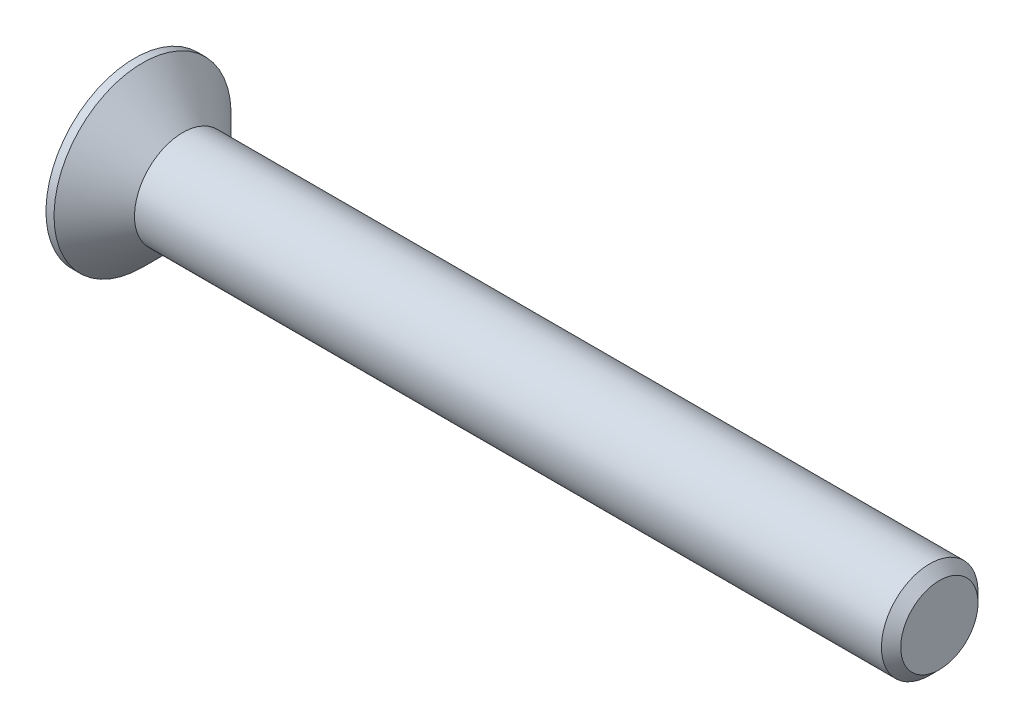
ISO-10303-21;
HEADER;
FILE_DESCRIPTION(('STEP AP214'),'2;1');
FILE_NAME('part.step','',(''),(''),'','','');
FILE_SCHEMA(('AUTOMOTIVE_DESIGN { 1 0 10303 214 1 1 1 1 }'));
ENDSEC;
DATA;
#1=APPLICATION_CONTEXT('core data for automotive mechanical design processes');
#2=APPLICATION_PROTOCOL_DEFINITION('international standard','automotive_design',2000,#1);
#3=PRODUCT_CONTEXT('',#1,'mechanical');
#4=PRODUCT('Part','Part','',(#3));
#5=PRODUCT_RELATED_PRODUCT_CATEGORY('part','',(#4));
#6=PRODUCT_DEFINITION_FORMATION('','',#4);
#7=PRODUCT_DEFINITION_CONTEXT('part definition',#1,'design');
#8=PRODUCT_DEFINITION('design','',#6,#7);
#9=PRODUCT_DEFINITION_SHAPE('','',#8);
#10=(LENGTH_UNIT() NAMED_UNIT(*) SI_UNIT(.MILLI.,.METRE.));
#11=(NAMED_UNIT(*) PLANE_ANGLE_UNIT() SI_UNIT($,.RADIAN.));
#12=(NAMED_UNIT(*) SI_UNIT($,.STERADIAN.) SOLID_ANGLE_UNIT());
#13=UNCERTAINTY_MEASURE_WITH_UNIT(LENGTH_MEASURE(1.E-05),#10,'distance_accuracy_value','');
#14=(GEOMETRIC_REPRESENTATION_CONTEXT(3) GLOBAL_UNCERTAINTY_ASSIGNED_CONTEXT((#13)) GLOBAL_UNIT_ASSIGNED_CONTEXT((#10,
#11,#12)) REPRESENTATION_CONTEXT('',''));
#15=CARTESIAN_POINT('',(0.,0.,0.));
#16=DIRECTION('',(0.,0.,1.));
#17=DIRECTION('',(1.,0.,0.));
#18=AXIS2_PLACEMENT_3D('',#15,#16,#17);
#19=CARTESIAN_POINT('',(0.,0.,0.));
#20=DIRECTION('',(-1.,0.,0.));
#21=DIRECTION('',(0.,-1.,0.));
#22=AXIS2_PLACEMENT_3D('',#19,#20,#21);
#23=CONICAL_SURFACE('',#22,3.,0.78539816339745);
#24=CARTESIAN_POINT('',(-2.49999999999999,0.,0.));
#25=DIRECTION('',(-1.,0.,0.));
#26=DIRECTION('',(0.,-1.,0.));
#27=AXIS2_PLACEMENT_3D('',#24,#25,#26);
#28=CIRCLE('',#27,5.5);
#29=CARTESIAN_POINT('',(-2.49999999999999,-5.5,0.));
#30=VERTEX_POINT('',#29);
#31=EDGE_CURVE('E189',#30,#30,#28,.T.);
#32=ORIENTED_EDGE('',*,*,#31,.F.);
#33=EDGE_LOOP('',(#32));
#34=FACE_BOUND('',#33,.T.);
#35=CARTESIAN_POINT('',(0.,0.,0.));
#36=DIRECTION('',(-1.,0.,0.));
#37=DIRECTION('',(0.,-1.,0.));
#38=AXIS2_PLACEMENT_3D('',#35,#36,#37);
#39=CIRCLE('',#38,3.);
#40=CARTESIAN_POINT('',(0.,-3.,0.));
#41=VERTEX_POINT('',#40);
#42=EDGE_CURVE('E212',#41,#41,#39,.T.);
#43=ORIENTED_EDGE('',*,*,#42,.T.);
#44=EDGE_LOOP('',(#43));
#45=FACE_BOUND('',#44,.T.);
#46=ADVANCED_FACE('F33',(#34,#45),#23,.T.);
#47=CARTESIAN_POINT('',(-3.,0.,0.));
#48=DIRECTION('',(-1.,0.,0.));
#49=DIRECTION('',(0.,-1.,0.));
#50=AXIS2_PLACEMENT_3D('',#47,#48,#49);
#51=CYLINDRICAL_SURFACE('',#50,3.);
#52=CARTESIAN_POINT('',(46.4,0.,0.));
#53=DIRECTION('',(-1.,0.,0.));
#54=DIRECTION('',(0.,-1.,0.));
#55=AXIS2_PLACEMENT_3D('',#52,#53,#54);
#56=CIRCLE('',#55,3.);
#57=CARTESIAN_POINT('',(46.4,-3.,0.));
#58=VERTEX_POINT('',#57);
#59=EDGE_CURVE('E41',#58,#58,#56,.T.);
#60=ORIENTED_EDGE('',*,*,#59,.T.);
#61=EDGE_LOOP('',(#60));
#62=FACE_BOUND('',#61,.T.);
#63=ORIENTED_EDGE('',*,*,#42,.F.);
#64=EDGE_LOOP('',(#63));
#65=FACE_BOUND('',#64,.T.);
#66=ADVANCED_FACE('F217',(#62,#65),#51,.T.);
#67=CARTESIAN_POINT('',(47.,0.,0.));
#68=DIRECTION('',(-1.,0.,0.));
#69=DIRECTION('',(0.,-1.,0.));
#70=AXIS2_PLACEMENT_3D('',#67,#68,#69);
#71=PLANE('',#70);
#72=CARTESIAN_POINT('',(47.,0.,0.));
#73=DIRECTION('',(-1.,0.,0.));
#74=DIRECTION('',(0.,-1.,0.));
#75=AXIS2_PLACEMENT_3D('',#72,#73,#74);
#76=CIRCLE('',#75,2.40000000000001);
#77=CARTESIAN_POINT('',(47.,-2.40000000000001,0.));
#78=VERTEX_POINT('',#77);
#79=EDGE_CURVE('E11',#78,#78,#76,.F.);
#80=ORIENTED_EDGE('',*,*,#79,.T.);
#81=EDGE_LOOP('',(#80));
#82=FACE_BOUND('',#81,.T.);
#83=ADVANCED_FACE('F239',(#82),#71,.F.);
#84=CARTESIAN_POINT('',(-3.,5.5,0.));
#85=DIRECTION('',(1.,0.,0.));
#86=DIRECTION('',(0.,1.,0.));
#87=AXIS2_PLACEMENT_3D('',#84,#85,#86);
#88=PLANE('',#87);
#89=DIRECTION('',(0.,0.,-1.));
#90=VECTOR('',#89,1.);
#91=CARTESIAN_POINT('',(-3.,0.825,-3.3));
#92=LINE('',#91,#90);
#93=CARTESIAN_POINT('',(-3.,0.825,-0.825));
#94=VERTEX_POINT('',#93);
#95=CARTESIAN_POINT('',(-3.,0.825,-3.3));
#96=VERTEX_POINT('',#95);
#97=EDGE_CURVE('E158',#94,#96,#92,.T.);
#98=ORIENTED_EDGE('',*,*,#97,.F.);
#99=DIRECTION('',(0.,-1.,0.));
#100=VECTOR('',#99,1.);
#101=CARTESIAN_POINT('',(-3.,0.825,-0.825));
#102=LINE('',#101,#100);
#103=CARTESIAN_POINT('',(-3.,3.3,-0.825));
#104=VERTEX_POINT('',#103);
#105=EDGE_CURVE('E48',#104,#94,#102,.T.);
#106=ORIENTED_EDGE('',*,*,#105,.F.);
#107=DIRECTION('',(0.,0.,-1.));
#108=VECTOR('',#107,1.);
#109=CARTESIAN_POINT('',(-3.,3.3,-0.825));
#110=LINE('',#109,#108);
#111=CARTESIAN_POINT('',(-3.,3.3,0.825));
#112=VERTEX_POINT('',#111);
#113=EDGE_CURVE('E185',#112,#104,#110,.T.);
#114=ORIENTED_EDGE('',*,*,#113,.F.);
#115=DIRECTION('',(0.,1.,0.));
#116=VECTOR('',#115,1.);
#117=CARTESIAN_POINT('',(-3.,3.3,0.825));
#118=LINE('',#117,#116);
#119=CARTESIAN_POINT('',(-3.,0.825,0.825));
#120=VERTEX_POINT('',#119);
#121=EDGE_CURVE('E183',#120,#112,#118,.T.);
#122=ORIENTED_EDGE('',*,*,#121,.F.);
#123=DIRECTION('',(0.,0.,-1.));
#124=VECTOR('',#123,1.);
#125=CARTESIAN_POINT('',(-3.,0.825,0.825));
#126=LINE('',#125,#124);
#127=CARTESIAN_POINT('',(-3.,0.825,3.3));
#128=VERTEX_POINT('',#127);
#129=EDGE_CURVE('E132',#128,#120,#126,.T.);
#130=ORIENTED_EDGE('',*,*,#129,.F.);
#131=DIRECTION('',(0.,1.,0.));
#132=VECTOR('',#131,1.);
#133=CARTESIAN_POINT('',(-3.,0.825,3.3));
#134=LINE('',#133,#132);
#135=CARTESIAN_POINT('',(-3.,-0.825,3.3));
#136=VERTEX_POINT('',#135);
#137=EDGE_CURVE('E179',#136,#128,#134,.T.);
#138=ORIENTED_EDGE('',*,*,#137,.F.);
#139=DIRECTION('',(0.,0.,1.));
#140=VECTOR('',#139,1.);
#141=CARTESIAN_POINT('',(-3.,-0.825,3.3));
#142=LINE('',#141,#140);
#143=CARTESIAN_POINT('',(-3.,-0.825,0.825));
#144=VERTEX_POINT('',#143);
#145=EDGE_CURVE('E176',#144,#136,#142,.T.);
#146=ORIENTED_EDGE('',*,*,#145,.F.);
#147=DIRECTION('',(0.,1.,0.));
#148=VECTOR('',#147,1.);
#149=CARTESIAN_POINT('',(-3.,-0.825,0.825));
#150=LINE('',#149,#148);
#151=CARTESIAN_POINT('',(-3.,-3.3,0.825));
#152=VERTEX_POINT('',#151);
#153=EDGE_CURVE('E173',#152,#144,#150,.T.);
#154=ORIENTED_EDGE('',*,*,#153,.F.);
#155=DIRECTION('',(0.,0.,1.));
#156=VECTOR('',#155,1.);
#157=CARTESIAN_POINT('',(-3.,-3.3,0.825));
#158=LINE('',#157,#156);
#159=CARTESIAN_POINT('',(-3.,-3.3,-0.825));
#160=VERTEX_POINT('',#159);
#161=EDGE_CURVE('E170',#160,#152,#158,.T.);
#162=ORIENTED_EDGE('',*,*,#161,.F.);
#163=DIRECTION('',(0.,-1.,0.));
#164=VECTOR('',#163,1.);
#165=CARTESIAN_POINT('',(-3.,-3.3,-0.825));
#166=LINE('',#165,#164);
#167=CARTESIAN_POINT('',(-3.,-0.825,-0.825));
#168=VERTEX_POINT('',#167);
#169=EDGE_CURVE('E167',#168,#160,#166,.T.);
#170=ORIENTED_EDGE('',*,*,#169,.F.);
#171=DIRECTION('',(0.,0.,1.));
#172=VECTOR('',#171,1.);
#173=CARTESIAN_POINT('',(-3.,-0.825,-0.825));
#174=LINE('',#173,#172);
#175=CARTESIAN_POINT('',(-3.,-0.825,-3.3));
#176=VERTEX_POINT('',#175);
#177=EDGE_CURVE('E164',#176,#168,#174,.T.);
#178=ORIENTED_EDGE('',*,*,#177,.F.);
#179=DIRECTION('',(0.,-1.,0.));
#180=VECTOR('',#179,1.);
#181=CARTESIAN_POINT('',(-3.,-0.825,-3.3));
#182=LINE('',#181,#180);
#183=EDGE_CURVE('E161',#96,#176,#182,.T.);
#184=ORIENTED_EDGE('',*,*,#183,.F.);
#185=EDGE_LOOP('',(#98,#106,#114,#122,#130,#138,#146,#154,#162,#170,#178,#184));
#186=FACE_BOUND('',#185,.T.);
#187=CARTESIAN_POINT('',(-3.,0.,0.));
#188=DIRECTION('',(-1.,0.,0.));
#189=DIRECTION('',(0.,-1.,0.));
#190=AXIS2_PLACEMENT_3D('',#187,#188,#189);
#191=CIRCLE('',#190,5.5);
#192=CARTESIAN_POINT('',(-3.,-5.5,0.));
#193=VERTEX_POINT('',#192);
#194=EDGE_CURVE('E209',#193,#193,#191,.T.);
#195=ORIENTED_EDGE('',*,*,#194,.T.);
#196=EDGE_LOOP('',(#195));
#197=FACE_BOUND('',#196,.T.);
#198=ADVANCED_FACE('F230',(#186,#197),#88,.F.);
#199=CARTESIAN_POINT('',(-3.,0.,0.));
#200=DIRECTION('',(-1.,0.,0.));
#201=DIRECTION('',(0.,-1.,0.));
#202=AXIS2_PLACEMENT_3D('',#199,#200,#201);
#203=CYLINDRICAL_SURFACE('',#202,5.5);
#204=ORIENTED_EDGE('',*,*,#194,.F.);
#205=EDGE_LOOP('',(#204));
#206=FACE_BOUND('',#205,.T.);
#207=ORIENTED_EDGE('',*,*,#31,.T.);
#208=EDGE_LOOP('',(#207));
#209=FACE_BOUND('',#208,.T.);
#210=ADVANCED_FACE('F222',(#206,#209),#203,.T.);
#211=CARTESIAN_POINT('',(46.4,0.,0.));
#212=DIRECTION('',(-1.,0.,0.));
#213=DIRECTION('',(0.,-1.,0.));
#214=AXIS2_PLACEMENT_3D('',#211,#212,#213);
#215=CONICAL_SURFACE('',#214,3.,0.785398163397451);
#216=ORIENTED_EDGE('',*,*,#79,.F.);
#217=EDGE_LOOP('',(#216));
#218=FACE_BOUND('',#217,.T.);
#219=ORIENTED_EDGE('',*,*,#59,.F.);
#220=EDGE_LOOP('',(#219));
#221=FACE_BOUND('',#220,.T.);
#222=ADVANCED_FACE('F35',(#218,#221),#215,.T.);
#223=CARTESIAN_POINT('',(-0.5,0.825,-0.825));
#224=DIRECTION('',(0.,0.,-1.));
#225=DIRECTION('',(-1.,0.,0.));
#226=AXIS2_PLACEMENT_3D('',#223,#224,#225);
#227=PLANE('',#226);
#228=ORIENTED_EDGE('',*,*,#105,.T.);
#229=DIRECTION('',(-1.,0.,0.));
#230=VECTOR('',#229,1.);
#231=CARTESIAN_POINT('',(-0.5,0.825,-0.825));
#232=LINE('',#231,#230);
#233=CARTESIAN_POINT('',(-0.5,0.825,-0.825));
#234=VERTEX_POINT('',#233);
#235=EDGE_CURVE('E96',#234,#94,#232,.T.);
#236=ORIENTED_EDGE('',*,*,#235,.F.);
#237=DIRECTION('',(0.,-1.,0.));
#238=VECTOR('',#237,1.);
#239=CARTESIAN_POINT('',(-0.5,0.825,-0.825));
#240=LINE('',#239,#238);
#241=CARTESIAN_POINT('',(-0.5,3.3,-0.825));
#242=VERTEX_POINT('',#241);
#243=EDGE_CURVE('E187',#242,#234,#240,.T.);
#244=ORIENTED_EDGE('',*,*,#243,.F.);
#245=DIRECTION('',(-1.,0.,0.));
#246=VECTOR('',#245,1.);
#247=CARTESIAN_POINT('',(-0.5,3.3,-0.825));
#248=LINE('',#247,#246);
#249=EDGE_CURVE('E56',#242,#104,#248,.T.);
#250=ORIENTED_EDGE('',*,*,#249,.T.);
#251=EDGE_LOOP('',(#228,#236,#244,#250));
#252=FACE_BOUND('',#251,.T.);
#253=ADVANCED_FACE('F221',(#252),#227,.F.);
#254=CARTESIAN_POINT('',(-0.5,3.3,-0.825));
#255=DIRECTION('',(0.,1.,0.));
#256=DIRECTION('',(-1.,0.,0.));
#257=AXIS2_PLACEMENT_3D('',#254,#255,#256);
#258=PLANE('',#257);
#259=ORIENTED_EDGE('',*,*,#113,.T.);
#260=ORIENTED_EDGE('',*,*,#249,.F.);
#261=DIRECTION('',(0.,0.,-1.));
#262=VECTOR('',#261,1.);
#263=CARTESIAN_POINT('',(-0.5,3.3,-0.825));
#264=LINE('',#263,#262);
#265=CARTESIAN_POINT('',(-0.5,3.3,0.825));
#266=VERTEX_POINT('',#265);
#267=EDGE_CURVE('E144',#266,#242,#264,.T.);
#268=ORIENTED_EDGE('',*,*,#267,.F.);
#269=DIRECTION('',(-1.,0.,0.));
#270=VECTOR('',#269,1.);
#271=CARTESIAN_POINT('',(-0.5,3.3,0.825));
#272=LINE('',#271,#270);
#273=EDGE_CURVE('E136',#266,#112,#272,.T.);
#274=ORIENTED_EDGE('',*,*,#273,.T.);
#275=EDGE_LOOP('',(#259,#260,#268,#274));
#276=FACE_BOUND('',#275,.T.);
#277=ADVANCED_FACE('F228',(#276),#258,.F.);
#278=CARTESIAN_POINT('',(-0.5,3.3,0.825));
#279=DIRECTION('',(0.,0.,1.));
#280=DIRECTION('',(1.,0.,0.));
#281=AXIS2_PLACEMENT_3D('',#278,#279,#280);
#282=PLANE('',#281);
#283=ORIENTED_EDGE('',*,*,#121,.T.);
#284=ORIENTED_EDGE('',*,*,#273,.F.);
#285=DIRECTION('',(0.,1.,0.));
#286=VECTOR('',#285,1.);
#287=CARTESIAN_POINT('',(-0.5,3.3,0.825));
#288=LINE('',#287,#286);
#289=CARTESIAN_POINT('',(-0.5,0.825,0.825));
#290=VERTEX_POINT('',#289);
#291=EDGE_CURVE('E140',#290,#266,#288,.T.);
#292=ORIENTED_EDGE('',*,*,#291,.F.);
#293=DIRECTION('',(-1.,0.,0.));
#294=VECTOR('',#293,1.);
#295=CARTESIAN_POINT('',(-0.5,0.825,0.825));
#296=LINE('',#295,#294);
#297=EDGE_CURVE('E125',#290,#120,#296,.T.);
#298=ORIENTED_EDGE('',*,*,#297,.T.);
#299=EDGE_LOOP('',(#283,#284,#292,#298));
#300=FACE_BOUND('',#299,.T.);
#301=ADVANCED_FACE('F141',(#300),#282,.F.);
#302=CARTESIAN_POINT('',(-0.5,0.825,0.825));
#303=DIRECTION('',(0.,1.,0.));
#304=DIRECTION('',(-1.,0.,0.));
#305=AXIS2_PLACEMENT_3D('',#302,#303,#304);
#306=PLANE('',#305);
#307=ORIENTED_EDGE('',*,*,#129,.T.);
#308=ORIENTED_EDGE('',*,*,#297,.F.);
#309=DIRECTION('',(0.,0.,-1.));
#310=VECTOR('',#309,1.);
#311=CARTESIAN_POINT('',(-0.5,0.825,0.825));
#312=LINE('',#311,#310);
#313=CARTESIAN_POINT('',(-0.5,0.825,3.3));
#314=VERTEX_POINT('',#313);
#315=EDGE_CURVE('E129',#314,#290,#312,.T.);
#316=ORIENTED_EDGE('',*,*,#315,.F.);
#317=DIRECTION('',(-1.,0.,0.));
#318=VECTOR('',#317,1.);
#319=CARTESIAN_POINT('',(-0.5,0.825,3.3));
#320=LINE('',#319,#318);
#321=EDGE_CURVE('E137',#314,#128,#320,.T.);
#322=ORIENTED_EDGE('',*,*,#321,.T.);
#323=EDGE_LOOP('',(#307,#308,#316,#322));
#324=FACE_BOUND('',#323,.T.);
#325=ADVANCED_FACE('F127',(#324),#306,.F.);
#326=CARTESIAN_POINT('',(-0.5,0.825,3.3));
#327=DIRECTION('',(0.,0.,1.));
#328=DIRECTION('',(1.,0.,0.));
#329=AXIS2_PLACEMENT_3D('',#326,#327,#328);
#330=PLANE('',#329);
#331=ORIENTED_EDGE('',*,*,#137,.T.);
#332=ORIENTED_EDGE('',*,*,#321,.F.);
#333=DIRECTION('',(0.,1.,0.));
#334=VECTOR('',#333,1.);
#335=CARTESIAN_POINT('',(-0.5,0.825,3.3));
#336=LINE('',#335,#334);
#337=CARTESIAN_POINT('',(-0.5,-0.825,3.3));
#338=VERTEX_POINT('',#337);
#339=EDGE_CURVE('E150',#338,#314,#336,.T.);
#340=ORIENTED_EDGE('',*,*,#339,.F.);
#341=DIRECTION('',(-1.,0.,0.));
#342=VECTOR('',#341,1.);
#343=CARTESIAN_POINT('',(-0.5,-0.825,3.3));
#344=LINE('',#343,#342);
#345=EDGE_CURVE('E192',#338,#136,#344,.T.);
#346=ORIENTED_EDGE('',*,*,#345,.T.);
#347=EDGE_LOOP('',(#331,#332,#340,#346));
#348=FACE_BOUND('',#347,.T.);
#349=ADVANCED_FACE('F277',(#348),#330,.F.);
#350=CARTESIAN_POINT('',(-0.5,-0.825,3.3));
#351=DIRECTION('',(0.,-1.,0.));
#352=DIRECTION('',(1.,0.,0.));
#353=AXIS2_PLACEMENT_3D('',#350,#351,#352);
#354=PLANE('',#353);
#355=ORIENTED_EDGE('',*,*,#145,.T.);
#356=ORIENTED_EDGE('',*,*,#345,.F.);
#357=DIRECTION('',(0.,0.,1.));
#358=VECTOR('',#357,1.);
#359=CARTESIAN_POINT('',(-0.5,-0.825,3.3));
#360=LINE('',#359,#358);
#361=CARTESIAN_POINT('',(-0.5,-0.825,0.825));
#362=VERTEX_POINT('',#361);
#363=EDGE_CURVE('E152',#362,#338,#360,.T.);
#364=ORIENTED_EDGE('',*,*,#363,.F.);
#365=DIRECTION('',(-1.,0.,0.));
#366=VECTOR('',#365,1.);
#367=CARTESIAN_POINT('',(-0.5,-0.825,0.825));
#368=LINE('',#367,#366);
#369=EDGE_CURVE('E194',#362,#144,#368,.T.);
#370=ORIENTED_EDGE('',*,*,#369,.T.);
#371=EDGE_LOOP('',(#355,#356,#364,#370));
#372=FACE_BOUND('',#371,.T.);
#373=ADVANCED_FACE('F273',(#372),#354,.F.);
#374=CARTESIAN_POINT('',(-0.5,-0.825,0.825));
#375=DIRECTION('',(0.,0.,1.));
#376=DIRECTION('',(1.,0.,0.));
#377=AXIS2_PLACEMENT_3D('',#374,#375,#376);
#378=PLANE('',#377);
#379=ORIENTED_EDGE('',*,*,#153,.T.);
#380=ORIENTED_EDGE('',*,*,#369,.F.);
#381=DIRECTION('',(0.,1.,0.));
#382=VECTOR('',#381,1.);
#383=CARTESIAN_POINT('',(-0.5,-0.825,0.825));
#384=LINE('',#383,#382);
#385=CARTESIAN_POINT('',(-0.5,-3.3,0.825));
#386=VERTEX_POINT('',#385);
#387=EDGE_CURVE('E422',#386,#362,#384,.T.);
#388=ORIENTED_EDGE('',*,*,#387,.F.);
#389=DIRECTION('',(-1.,0.,0.));
#390=VECTOR('',#389,1.);
#391=CARTESIAN_POINT('',(-0.5,-3.3,0.825));
#392=LINE('',#391,#390);
#393=EDGE_CURVE('E196',#386,#152,#392,.T.);
#394=ORIENTED_EDGE('',*,*,#393,.T.);
#395=EDGE_LOOP('',(#379,#380,#388,#394));
#396=FACE_BOUND('',#395,.T.);
#397=ADVANCED_FACE('F269',(#396),#378,.F.);
#398=CARTESIAN_POINT('',(-0.5,-3.3,0.825));
#399=DIRECTION('',(0.,-1.,0.));
#400=DIRECTION('',(1.,0.,0.));
#401=AXIS2_PLACEMENT_3D('',#398,#399,#400);
#402=PLANE('',#401);
#403=ORIENTED_EDGE('',*,*,#161,.T.);
#404=ORIENTED_EDGE('',*,*,#393,.F.);
#405=DIRECTION('',(0.,0.,1.));
#406=VECTOR('',#405,1.);
#407=CARTESIAN_POINT('',(-0.5,-3.3,0.825));
#408=LINE('',#407,#406);
#409=CARTESIAN_POINT('',(-0.5,-3.3,-0.825));
#410=VERTEX_POINT('',#409);
#411=EDGE_CURVE('E419',#410,#386,#408,.T.);
#412=ORIENTED_EDGE('',*,*,#411,.F.);
#413=DIRECTION('',(-1.,0.,0.));
#414=VECTOR('',#413,1.);
#415=CARTESIAN_POINT('',(-0.5,-3.3,-0.825));
#416=LINE('',#415,#414);
#417=EDGE_CURVE('E198',#410,#160,#416,.T.);
#418=ORIENTED_EDGE('',*,*,#417,.T.);
#419=EDGE_LOOP('',(#403,#404,#412,#418));
#420=FACE_BOUND('',#419,.T.);
#421=ADVANCED_FACE('F265',(#420),#402,.F.);
#422=CARTESIAN_POINT('',(-0.5,-3.3,-0.825));
#423=DIRECTION('',(0.,0.,-1.));
#424=DIRECTION('',(-1.,0.,0.));
#425=AXIS2_PLACEMENT_3D('',#422,#423,#424);
#426=PLANE('',#425);
#427=ORIENTED_EDGE('',*,*,#169,.T.);
#428=ORIENTED_EDGE('',*,*,#417,.F.);
#429=DIRECTION('',(0.,-1.,0.));
#430=VECTOR('',#429,1.);
#431=CARTESIAN_POINT('',(-0.5,-3.3,-0.825));
#432=LINE('',#431,#430);
#433=CARTESIAN_POINT('',(-0.5,-0.825,-0.825));
#434=VERTEX_POINT('',#433);
#435=EDGE_CURVE('E416',#434,#410,#432,.T.);
#436=ORIENTED_EDGE('',*,*,#435,.F.);
#437=DIRECTION('',(-1.,0.,0.));
#438=VECTOR('',#437,1.);
#439=CARTESIAN_POINT('',(-0.5,-0.825,-0.825));
#440=LINE('',#439,#438);
#441=EDGE_CURVE('E200',#434,#168,#440,.T.);
#442=ORIENTED_EDGE('',*,*,#441,.T.);
#443=EDGE_LOOP('',(#427,#428,#436,#442));
#444=FACE_BOUND('',#443,.T.);
#445=ADVANCED_FACE('F261',(#444),#426,.F.);
#446=CARTESIAN_POINT('',(-0.5,-0.825,-0.825));
#447=DIRECTION('',(0.,-1.,0.));
#448=DIRECTION('',(1.,0.,0.));
#449=AXIS2_PLACEMENT_3D('',#446,#447,#448);
#450=PLANE('',#449);
#451=ORIENTED_EDGE('',*,*,#177,.T.);
#452=ORIENTED_EDGE('',*,*,#441,.F.);
#453=DIRECTION('',(0.,0.,1.));
#454=VECTOR('',#453,1.);
#455=CARTESIAN_POINT('',(-0.5,-0.825,-0.825));
#456=LINE('',#455,#454);
#457=CARTESIAN_POINT('',(-0.5,-0.825,-3.3));
#458=VERTEX_POINT('',#457);
#459=EDGE_CURVE('E413',#458,#434,#456,.T.);
#460=ORIENTED_EDGE('',*,*,#459,.F.);
#461=DIRECTION('',(-1.,0.,0.));
#462=VECTOR('',#461,1.);
#463=CARTESIAN_POINT('',(-0.5,-0.825,-3.3));
#464=LINE('',#463,#462);
#465=EDGE_CURVE('E202',#458,#176,#464,.T.);
#466=ORIENTED_EDGE('',*,*,#465,.T.);
#467=EDGE_LOOP('',(#451,#452,#460,#466));
#468=FACE_BOUND('',#467,.T.);
#469=ADVANCED_FACE('F257',(#468),#450,.F.);
#470=CARTESIAN_POINT('',(-0.5,-0.825,-3.3));
#471=DIRECTION('',(0.,0.,-1.));
#472=DIRECTION('',(-1.,0.,0.));
#473=AXIS2_PLACEMENT_3D('',#470,#471,#472);
#474=PLANE('',#473);
#475=ORIENTED_EDGE('',*,*,#183,.T.);
#476=ORIENTED_EDGE('',*,*,#465,.F.);
#477=DIRECTION('',(0.,-1.,0.));
#478=VECTOR('',#477,1.);
#479=CARTESIAN_POINT('',(-0.5,-0.825,-3.3));
#480=LINE('',#479,#478);
#481=CARTESIAN_POINT('',(-0.5,0.825,-3.3));
#482=VERTEX_POINT('',#481);
#483=EDGE_CURVE('E408',#482,#458,#480,.T.);
#484=ORIENTED_EDGE('',*,*,#483,.F.);
#485=DIRECTION('',(-1.,0.,0.));
#486=VECTOR('',#485,1.);
#487=CARTESIAN_POINT('',(-0.5,0.825,-3.3));
#488=LINE('',#487,#486);
#489=EDGE_CURVE('E204',#482,#96,#488,.T.);
#490=ORIENTED_EDGE('',*,*,#489,.T.);
#491=EDGE_LOOP('',(#475,#476,#484,#490));
#492=FACE_BOUND('',#491,.T.);
#493=ADVANCED_FACE('F253',(#492),#474,.F.);
#494=CARTESIAN_POINT('',(-0.5,0.825,-3.3));
#495=DIRECTION('',(0.,1.,0.));
#496=DIRECTION('',(-1.,0.,0.));
#497=AXIS2_PLACEMENT_3D('',#494,#495,#496);
#498=PLANE('',#497);
#499=ORIENTED_EDGE('',*,*,#97,.T.);
#500=ORIENTED_EDGE('',*,*,#489,.F.);
#501=DIRECTION('',(0.,0.,-1.));
#502=VECTOR('',#501,1.);
#503=CARTESIAN_POINT('',(-0.5,0.825,-3.3));
#504=LINE('',#503,#502);
#505=EDGE_CURVE('E406',#234,#482,#504,.T.);
#506=ORIENTED_EDGE('',*,*,#505,.F.);
#507=ORIENTED_EDGE('',*,*,#235,.T.);
#508=EDGE_LOOP('',(#499,#500,#506,#507));
#509=FACE_BOUND('',#508,.T.);
#510=ADVANCED_FACE('F250',(#509),#498,.F.);
#511=CARTESIAN_POINT('',(-0.5,0.,0.));
#512=DIRECTION('',(1.,0.,0.));
#513=DIRECTION('',(0.,0.,-1.));
#514=AXIS2_PLACEMENT_3D('',#511,#512,#513);
#515=PLANE('',#514);
#516=ORIENTED_EDGE('',*,*,#243,.T.);
#517=ORIENTED_EDGE('',*,*,#505,.T.);
#518=ORIENTED_EDGE('',*,*,#483,.T.);
#519=ORIENTED_EDGE('',*,*,#459,.T.);
#520=ORIENTED_EDGE('',*,*,#435,.T.);
#521=ORIENTED_EDGE('',*,*,#411,.T.);
#522=ORIENTED_EDGE('',*,*,#387,.T.);
#523=ORIENTED_EDGE('',*,*,#363,.T.);
#524=ORIENTED_EDGE('',*,*,#339,.T.);
#525=ORIENTED_EDGE('',*,*,#315,.T.);
#526=ORIENTED_EDGE('',*,*,#291,.T.);
#527=ORIENTED_EDGE('',*,*,#267,.T.);
#528=EDGE_LOOP('',(#516,#517,#518,#519,#520,#521,#522,#523,#524,#525,#526,#527));
#529=FACE_BOUND('',#528,.T.);
#530=ADVANCED_FACE('F147',(#529),#515,.F.);
#531=CLOSED_SHELL('',(#46,#66,#83,#198,#210,#222,#253,#277,#301,#325,#349,#373,#397,#421,#445,
#469,#493,#510,#530));
#532=MANIFOLD_SOLID_BREP('B2',#531);
#533=ADVANCED_BREP_SHAPE_REPRESENTATION('',(#18,#532),#14);
#534=SHAPE_DEFINITION_REPRESENTATION(#9,#533);
ENDSEC;
END-ISO-10303-21;
